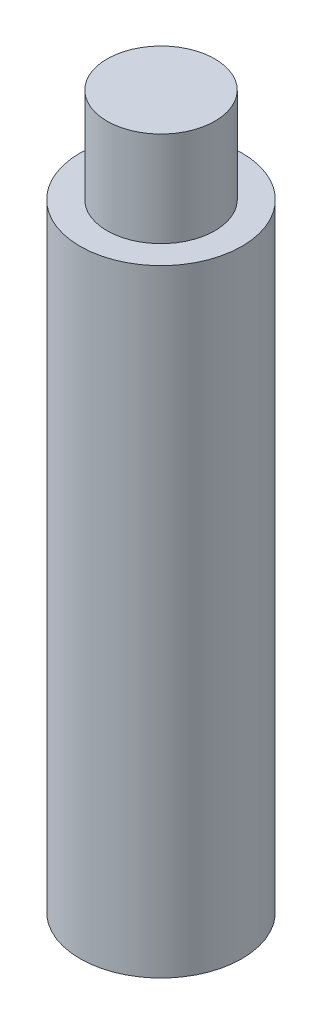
from build123d import *

# Parameters (mm, degrees)
SKETCH1_R          = 9.525
EXTRUDE1_DEPTH     = 72.644
SKETCH2_R          = 2.9845
CUT_EXTRUDE1_DEPTH = 50.8
SKETCH3_R          = 6.35
EXTRUDE2_DEPTH     = 11.176


with BuildPart() as part:
    # Sketch1 → Extrude1 (new body)
    with BuildSketch(Plane(origin=(0, 0, 0), x_dir=(1, 0, 0), z_dir=(0, 1, 0))):
        with Locations(Location((0, 0, 0), (0, 0, 270))):
            Circle(SKETCH1_R)
    extrude(amount=EXTRUDE1_DEPTH)

    # Sketch2 → Cut-Extrude1 (cut)
    with BuildSketch(Plane.XZ):
        with Locations(Location((0, 0, 0), (0, 0, 270))):
            Circle(SKETCH2_R)
    extrude(amount=-CUT_EXTRUDE1_DEPTH, mode=Mode.SUBTRACT)

    # Sketch3 → Extrude2 (add)
    with BuildSketch(Plane(origin=(0, 72.644, 0), x_dir=(-1, 0, 0), z_dir=(0, 1, 0))):
        with Locations(Location((0, 0, 0), (0, 0, 90))):
            Circle(SKETCH3_R)
    extrude(amount=EXTRUDE2_DEPTH)


solid = part.part
